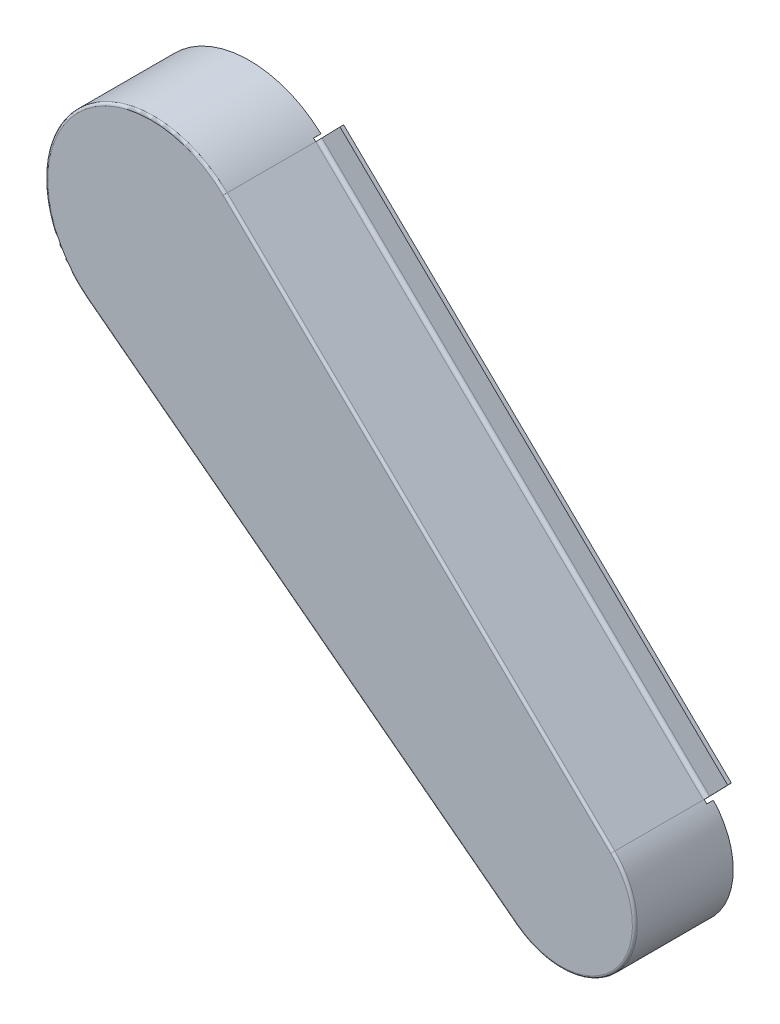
ISO-10303-21;
HEADER;
FILE_DESCRIPTION(('STEP AP214'),'2;1');
FILE_NAME('part.step','',(''),(''),'','','');
FILE_SCHEMA(('AUTOMOTIVE_DESIGN { 1 0 10303 214 1 1 1 1 }'));
ENDSEC;
DATA;
#1=APPLICATION_CONTEXT('core data for automotive mechanical design processes');
#2=APPLICATION_PROTOCOL_DEFINITION('international standard','automotive_design',2000,#1);
#3=PRODUCT_CONTEXT('',#1,'mechanical');
#4=PRODUCT('Part','Part','',(#3));
#5=PRODUCT_RELATED_PRODUCT_CATEGORY('part','',(#4));
#6=PRODUCT_DEFINITION_FORMATION('','',#4);
#7=PRODUCT_DEFINITION_CONTEXT('part definition',#1,'design');
#8=PRODUCT_DEFINITION('design','',#6,#7);
#9=PRODUCT_DEFINITION_SHAPE('','',#8);
#10=(LENGTH_UNIT() NAMED_UNIT(*) SI_UNIT(.MILLI.,.METRE.));
#11=(NAMED_UNIT(*) PLANE_ANGLE_UNIT() SI_UNIT($,.RADIAN.));
#12=(NAMED_UNIT(*) SI_UNIT($,.STERADIAN.) SOLID_ANGLE_UNIT());
#13=UNCERTAINTY_MEASURE_WITH_UNIT(LENGTH_MEASURE(1.E-05),#10,'distance_accuracy_value','');
#14=(GEOMETRIC_REPRESENTATION_CONTEXT(3) GLOBAL_UNCERTAINTY_ASSIGNED_CONTEXT((#13)) GLOBAL_UNIT_ASSIGNED_CONTEXT((#10,
#11,#12)) REPRESENTATION_CONTEXT('',''));
#15=CARTESIAN_POINT('',(0.,0.,0.));
#16=DIRECTION('',(0.,0.,1.));
#17=DIRECTION('',(1.,0.,0.));
#18=AXIS2_PLACEMENT_3D('',#15,#16,#17);
#19=CARTESIAN_POINT('',(28.2019886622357,29.0671263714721,37.5));
#20=DIRECTION('',(0.717706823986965,-0.696345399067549,0.));
#21=DIRECTION('',(0.696345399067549,0.717706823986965,0.));
#22=AXIS2_PLACEMENT_3D('',#19,#20,#21);
#23=CYLINDRICAL_SURFACE('',#22,1.);
#24=DIRECTION('',(0.717706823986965,-0.696345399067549,0.));
#25=VECTOR('',#24,1.);
#26=CARTESIAN_POINT('',(28.2019886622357,29.0671263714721,38.5));
#27=LINE('',#26,#25);
#28=CARTESIAN_POINT('',(28.2019886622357,29.0671263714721,38.5));
#29=VERTEX_POINT('',#28);
#30=CARTESIAN_POINT('',(185.821584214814,-123.86116760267,38.5));
#31=VERTEX_POINT('',#30);
#32=EDGE_CURVE('E404',#29,#31,#27,.T.);
#33=ORIENTED_EDGE('',*,*,#32,.F.);
#34=CARTESIAN_POINT('',(28.2019886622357,29.0671263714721,37.5));
#35=DIRECTION('',(0.717706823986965,-0.696345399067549,0.));
#36=DIRECTION('',(0.696345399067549,0.717706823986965,0.));
#37=AXIS2_PLACEMENT_3D('',#34,#35,#36);
#38=CIRCLE('',#37,1.);
#39=CARTESIAN_POINT('',(28.8983340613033,29.784833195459,37.5));
#40=VERTEX_POINT('',#39);
#41=EDGE_CURVE('E436',#29,#40,#38,.F.);
#42=ORIENTED_EDGE('',*,*,#41,.T.);
#43=DIRECTION('',(0.717706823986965,-0.696345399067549,0.));
#44=VECTOR('',#43,1.);
#45=CARTESIAN_POINT('',(28.8983340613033,29.784833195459,37.5));
#46=LINE('',#45,#44);
#47=CARTESIAN_POINT('',(186.517929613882,-123.143460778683,37.5));
#48=VERTEX_POINT('',#47);
#49=EDGE_CURVE('E182',#48,#40,#46,.F.);
#50=ORIENTED_EDGE('',*,*,#49,.F.);
#51=CARTESIAN_POINT('',(185.821584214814,-123.86116760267,37.5));
#52=DIRECTION('',(0.717706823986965,-0.696345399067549,0.));
#53=DIRECTION('',(0.696345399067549,0.717706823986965,0.));
#54=AXIS2_PLACEMENT_3D('',#51,#52,#53);
#55=CIRCLE('',#54,1.);
#56=EDGE_CURVE('E397',#31,#48,#55,.F.);
#57=ORIENTED_EDGE('',*,*,#56,.F.);
#58=EDGE_LOOP('',(#33,#42,#50,#57));
#59=FACE_BOUND('',#58,.T.);
#60=ADVANCED_FACE('F17',(#59),#23,.F.);
#61=CARTESIAN_POINT('',(0.,0.,38.5));
#62=DIRECTION('',(0.,0.,-1.));
#63=DIRECTION('',(-1.,0.,0.));
#64=AXIS2_PLACEMENT_3D('',#61,#62,#63);
#65=PLANE('',#64);
#66=CARTESIAN_POINT('',(0.,0.,38.5));
#67=DIRECTION('',(0.,0.,1.));
#68=DIRECTION('',(0.696345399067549,0.717706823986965,0.));
#69=AXIS2_PLACEMENT_3D('',#66,#67,#68);
#70=CIRCLE('',#69,40.5);
#71=CARTESIAN_POINT('',(-40.5,0.,38.5));
#72=VERTEX_POINT('',#71);
#73=EDGE_CURVE('E439',#72,#29,#70,.F.);
#74=ORIENTED_EDGE('',*,*,#73,.T.);
#75=ORIENTED_EDGE('',*,*,#32,.T.);
#76=CARTESIAN_POINT('',(166.672085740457,-143.598105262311,38.5));
#77=DIRECTION('',(0.,0.,1.));
#78=DIRECTION('',(-0.606810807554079,-0.794846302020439,0.));
#79=AXIS2_PLACEMENT_3D('',#76,#77,#78);
#80=CIRCLE('',#79,27.5);
#81=CARTESIAN_POINT('',(149.98478853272,-165.456378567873,38.5));
#82=VERTEX_POINT('',#81);
#83=EDGE_CURVE('E471',#31,#82,#80,.F.);
#84=ORIENTED_EDGE('',*,*,#83,.T.);
#85=DIRECTION('',(-0.794846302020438,0.606810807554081,0.));
#86=VECTOR('',#85,1.);
#87=CARTESIAN_POINT('',(-24.5758377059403,-32.1912752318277,38.5));
#88=LINE('',#87,#86);
#89=CARTESIAN_POINT('',(-24.5758377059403,-32.1912752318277,38.5));
#90=VERTEX_POINT('',#89);
#91=EDGE_CURVE('E462',#82,#90,#88,.T.);
#92=ORIENTED_EDGE('',*,*,#91,.T.);
#93=CARTESIAN_POINT('',(0.,0.,38.5));
#94=DIRECTION('',(0.,0.,1.));
#95=DIRECTION('',(-1.,0.,0.));
#96=AXIS2_PLACEMENT_3D('',#93,#94,#95);
#97=CIRCLE('',#96,40.5);
#98=EDGE_CURVE('E411',#90,#72,#97,.F.);
#99=ORIENTED_EDGE('',*,*,#98,.T.);
#100=EDGE_LOOP('',(#74,#75,#84,#92,#99));
#101=FACE_BOUND('',#100,.T.);
#102=ADVANCED_FACE('F476',(#101),#65,.T.);
#103=CARTESIAN_POINT('',(38.2989969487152,39.4738753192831,0.));
#104=DIRECTION('',(-0.696345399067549,-0.717706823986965,0.));
#105=DIRECTION('',(0.717706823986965,-0.696345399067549,0.));
#106=AXIS2_PLACEMENT_3D('',#103,#104,#105);
#107=PLANE('',#106);
#108=DIRECTION('',(0.,0.,1.));
#109=VECTOR('',#108,1.);
#110=CARTESIAN_POINT('',(38.2989969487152,39.4738753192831,0.));
#111=LINE('',#110,#109);
#112=CARTESIAN_POINT('',(38.2989969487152,39.4738753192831,1.49999999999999));
#113=VERTEX_POINT('',#112);
#114=CARTESIAN_POINT('',(38.2989969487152,39.4738753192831,0.));
#115=VERTEX_POINT('',#114);
#116=EDGE_CURVE('E444',#113,#115,#111,.F.);
#117=ORIENTED_EDGE('',*,*,#116,.F.);
#118=DIRECTION('',(0.717706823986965,-0.696345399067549,0.));
#119=VECTOR('',#118,1.);
#120=CARTESIAN_POINT('',(38.2989969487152,39.4738753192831,1.5));
#121=LINE('',#120,#119);
#122=CARTESIAN_POINT('',(195.918592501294,-113.454418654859,1.49999999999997));
#123=VERTEX_POINT('',#122);
#124=EDGE_CURVE('E449',#113,#123,#121,.T.);
#125=ORIENTED_EDGE('',*,*,#124,.T.);
#126=DIRECTION('',(0.,0.,1.));
#127=VECTOR('',#126,1.);
#128=CARTESIAN_POINT('',(195.918592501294,-113.454418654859,0.));
#129=LINE('',#128,#127);
#130=CARTESIAN_POINT('',(195.918592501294,-113.454418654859,0.));
#131=VERTEX_POINT('',#130);
#132=EDGE_CURVE('E456',#131,#123,#129,.T.);
#133=ORIENTED_EDGE('',*,*,#132,.F.);
#134=DIRECTION('',(0.717706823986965,-0.696345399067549,0.));
#135=VECTOR('',#134,1.);
#136=CARTESIAN_POINT('',(38.2989969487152,39.4738753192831,0.));
#137=LINE('',#136,#135);
#138=EDGE_CURVE('E440',#115,#131,#137,.T.);
#139=ORIENTED_EDGE('',*,*,#138,.F.);
#140=EDGE_LOOP('',(#117,#125,#133,#139));
#141=FACE_BOUND('',#140,.T.);
#142=ADVANCED_FACE('F485',(#141),#107,.F.);
#143=CARTESIAN_POINT('',(30.2910248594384,31.220246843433,2.));
#144=DIRECTION('',(-0.717706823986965,0.696345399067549,0.));
#145=DIRECTION('',(-0.696345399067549,-0.717706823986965,0.));
#146=AXIS2_PLACEMENT_3D('',#143,#144,#145);
#147=CYLINDRICAL_SURFACE('',#146,2.);
#148=CARTESIAN_POINT('',(30.2910248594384,31.220246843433,2.));
#149=DIRECTION('',(-0.717706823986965,0.696345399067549,0.));
#150=DIRECTION('',(-0.696345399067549,-0.717706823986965,0.));
#151=AXIS2_PLACEMENT_3D('',#148,#149,#150);
#152=CIRCLE('',#151,2.);
#153=CARTESIAN_POINT('',(28.8983340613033,29.784833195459,2.));
#154=VERTEX_POINT('',#153);
#155=CARTESIAN_POINT('',(30.2910248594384,31.220246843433,0.));
#156=VERTEX_POINT('',#155);
#157=EDGE_CURVE('E202',#154,#156,#152,.F.);
#158=ORIENTED_EDGE('',*,*,#157,.T.);
#159=DIRECTION('',(-0.717706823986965,0.696345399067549,0.));
#160=VECTOR('',#159,1.);
#161=CARTESIAN_POINT('',(187.910620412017,-121.708047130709,0.));
#162=LINE('',#161,#160);
#163=CARTESIAN_POINT('',(187.910620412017,-121.708047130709,0.));
#164=VERTEX_POINT('',#163);
#165=EDGE_CURVE('E167',#164,#156,#162,.T.);
#166=ORIENTED_EDGE('',*,*,#165,.F.);
#167=CARTESIAN_POINT('',(187.910620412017,-121.708047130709,2.));
#168=DIRECTION('',(-0.717706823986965,0.696345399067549,0.));
#169=DIRECTION('',(-0.696345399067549,-0.717706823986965,0.));
#170=AXIS2_PLACEMENT_3D('',#167,#168,#169);
#171=CIRCLE('',#170,2.);
#172=CARTESIAN_POINT('',(186.517929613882,-123.143460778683,2.));
#173=VERTEX_POINT('',#172);
#174=EDGE_CURVE('E188',#164,#173,#171,.T.);
#175=ORIENTED_EDGE('',*,*,#174,.T.);
#176=DIRECTION('',(0.717706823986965,-0.696345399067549,0.));
#177=VECTOR('',#176,1.);
#178=CARTESIAN_POINT('',(28.8983340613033,29.784833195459,2.));
#179=LINE('',#178,#177);
#180=EDGE_CURVE('E173',#154,#173,#179,.T.);
#181=ORIENTED_EDGE('',*,*,#180,.F.);
#182=EDGE_LOOP('',(#158,#166,#175,#181));
#183=FACE_BOUND('',#182,.T.);
#184=ADVANCED_FACE('F195',(#183),#147,.T.);
#185=CARTESIAN_POINT('',(0.,0.,0.));
#186=DIRECTION('',(0.,0.,-1.));
#187=DIRECTION('',(-1.,0.,0.));
#188=AXIS2_PLACEMENT_3D('',#185,#186,#187);
#189=PLANE('',#188);
#190=DIRECTION('',(0.696345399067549,0.717706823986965,0.));
#191=VECTOR('',#190,1.);
#192=CARTESIAN_POINT('',(38.2989969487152,39.4738753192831,0.));
#193=LINE('',#192,#191);
#194=EDGE_CURVE('E342',#156,#115,#193,.T.);
#195=ORIENTED_EDGE('',*,*,#194,.T.);
#196=ORIENTED_EDGE('',*,*,#138,.T.);
#197=DIRECTION('',(-0.696345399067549,-0.717706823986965,0.));
#198=VECTOR('',#197,1.);
#199=CARTESIAN_POINT('',(195.918592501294,-113.454418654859,0.));
#200=LINE('',#199,#198);
#201=EDGE_CURVE('E196',#131,#164,#200,.T.);
#202=ORIENTED_EDGE('',*,*,#201,.T.);
#203=ORIENTED_EDGE('',*,*,#165,.T.);
#204=EDGE_LOOP('',(#195,#196,#202,#203));
#205=FACE_BOUND('',#204,.T.);
#206=ADVANCED_FACE('F428',(#205),#189,.T.);
#207=CARTESIAN_POINT('',(0.,0.,37.5));
#208=DIRECTION('',(0.,0.,-1.));
#209=DIRECTION('',(-1.,0.,0.));
#210=AXIS2_PLACEMENT_3D('',#207,#208,#209);
#211=TOROIDAL_SURFACE('',#210,40.5,1.);
#212=ORIENTED_EDGE('',*,*,#98,.F.);
#213=CARTESIAN_POINT('',(-24.5758377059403,-32.1912752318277,37.5));
#214=DIRECTION('',(-0.794846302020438,0.606810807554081,0.));
#215=DIRECTION('',(-0.606810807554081,-0.794846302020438,0.));
#216=AXIS2_PLACEMENT_3D('',#213,#214,#215);
#217=CIRCLE('',#216,1.);
#218=CARTESIAN_POINT('',(-25.1826485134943,-32.9861215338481,37.5));
#219=VERTEX_POINT('',#218);
#220=EDGE_CURVE('E183',#90,#219,#217,.F.);
#221=ORIENTED_EDGE('',*,*,#220,.T.);
#222=CARTESIAN_POINT('',(0.,0.,37.5));
#223=DIRECTION('',(0.,0.,-1.));
#224=DIRECTION('',(-1.,0.,0.));
#225=AXIS2_PLACEMENT_3D('',#222,#223,#224);
#226=CIRCLE('',#225,41.5);
#227=EDGE_CURVE('E337',#219,#40,#226,.T.);
#228=ORIENTED_EDGE('',*,*,#227,.T.);
#229=ORIENTED_EDGE('',*,*,#41,.F.);
#230=ORIENTED_EDGE('',*,*,#73,.F.);
#231=EDGE_LOOP('',(#212,#221,#228,#229,#230));
#232=FACE_BOUND('',#231,.T.);
#233=ADVANCED_FACE('F417',(#232),#211,.F.);
#234=CARTESIAN_POINT('',(-24.5758377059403,-32.1912752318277,37.5));
#235=DIRECTION('',(-0.794846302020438,0.606810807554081,0.));
#236=DIRECTION('',(-0.606810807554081,-0.794846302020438,0.));
#237=AXIS2_PLACEMENT_3D('',#234,#235,#236);
#238=CYLINDRICAL_SURFACE('',#237,1.);
#239=ORIENTED_EDGE('',*,*,#91,.F.);
#240=CARTESIAN_POINT('',(149.98478853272,-165.456378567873,37.5));
#241=DIRECTION('',(-0.794846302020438,0.606810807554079,0.));
#242=DIRECTION('',(-0.606810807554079,-0.794846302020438,0.));
#243=AXIS2_PLACEMENT_3D('',#240,#241,#242);
#244=CIRCLE('',#243,1.);
#245=CARTESIAN_POINT('',(149.377977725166,-166.251224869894,37.5));
#246=VERTEX_POINT('',#245);
#247=EDGE_CURVE('E378',#82,#246,#244,.F.);
#248=ORIENTED_EDGE('',*,*,#247,.T.);
#249=DIRECTION('',(-0.794846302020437,0.606810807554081,0.));
#250=VECTOR('',#249,1.);
#251=CARTESIAN_POINT('',(-25.1826485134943,-32.9861215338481,37.5));
#252=LINE('',#251,#250);
#253=EDGE_CURVE('E336',#219,#246,#252,.F.);
#254=ORIENTED_EDGE('',*,*,#253,.F.);
#255=ORIENTED_EDGE('',*,*,#220,.F.);
#256=EDGE_LOOP('',(#239,#248,#254,#255));
#257=FACE_BOUND('',#256,.T.);
#258=ADVANCED_FACE('F427',(#257),#238,.F.);
#259=CARTESIAN_POINT('',(28.8983340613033,29.784833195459,40.));
#260=DIRECTION('',(-0.696345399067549,-0.717706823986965,0.));
#261=DIRECTION('',(0.717706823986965,-0.696345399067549,0.));
#262=AXIS2_PLACEMENT_3D('',#259,#260,#261);
#263=PLANE('',#262);
#264=ORIENTED_EDGE('',*,*,#49,.T.);
#265=DIRECTION('',(0.,0.,-1.));
#266=VECTOR('',#265,1.);
#267=CARTESIAN_POINT('',(28.8983340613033,29.784833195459,40.));
#268=LINE('',#267,#266);
#269=CARTESIAN_POINT('',(28.8983340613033,29.784833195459,3.00000000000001));
#270=VERTEX_POINT('',#269);
#271=EDGE_CURVE('E345',#40,#270,#268,.T.);
#272=ORIENTED_EDGE('',*,*,#271,.T.);
#273=DIRECTION('',(0.,0.,1.));
#274=VECTOR('',#273,1.);
#275=CARTESIAN_POINT('',(28.8983340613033,29.7848331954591,0.));
#276=LINE('',#275,#274);
#277=EDGE_CURVE('E180',#270,#154,#276,.F.);
#278=ORIENTED_EDGE('',*,*,#277,.T.);
#279=ORIENTED_EDGE('',*,*,#180,.T.);
#280=DIRECTION('',(0.,0.,1.));
#281=VECTOR('',#280,1.);
#282=CARTESIAN_POINT('',(186.517929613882,-123.143460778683,0.));
#283=LINE('',#282,#281);
#284=CARTESIAN_POINT('',(186.517929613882,-123.143460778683,2.71831865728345));
#285=VERTEX_POINT('',#284);
#286=EDGE_CURVE('E178',#173,#285,#283,.T.);
#287=ORIENTED_EDGE('',*,*,#286,.T.);
#288=DIRECTION('',(0.,0.,-1.));
#289=VECTOR('',#288,1.);
#290=CARTESIAN_POINT('',(186.517929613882,-123.143460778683,40.));
#291=LINE('',#290,#289);
#292=EDGE_CURVE('E373',#285,#48,#291,.F.);
#293=ORIENTED_EDGE('',*,*,#292,.T.);
#294=EDGE_LOOP('',(#264,#272,#278,#279,#287,#293));
#295=FACE_BOUND('',#294,.T.);
#296=ADVANCED_FACE('F176',(#295),#263,.T.);
#297=CARTESIAN_POINT('',(166.672085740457,-143.598105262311,37.5));
#298=DIRECTION('',(0.,0.,-1.));
#299=DIRECTION('',(-1.,0.,0.));
#300=AXIS2_PLACEMENT_3D('',#297,#298,#299);
#301=TOROIDAL_SURFACE('',#300,27.5,1.);
#302=CARTESIAN_POINT('',(166.672085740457,-143.598105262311,37.5));
#303=DIRECTION('',(0.,0.,-1.));
#304=DIRECTION('',(-1.,0.,0.));
#305=AXIS2_PLACEMENT_3D('',#302,#303,#304);
#306=CIRCLE('',#305,28.5);
#307=EDGE_CURVE('E330',#48,#246,#306,.T.);
#308=ORIENTED_EDGE('',*,*,#307,.T.);
#309=ORIENTED_EDGE('',*,*,#247,.F.);
#310=ORIENTED_EDGE('',*,*,#83,.F.);
#311=ORIENTED_EDGE('',*,*,#56,.T.);
#312=EDGE_LOOP('',(#308,#309,#310,#311));
#313=FACE_BOUND('',#312,.T.);
#314=ADVANCED_FACE('F381',(#313),#301,.F.);
#315=CARTESIAN_POINT('',(38.2989969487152,39.4738753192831,1.5));
#316=DIRECTION('',(0.,0.,-1.));
#317=DIRECTION('',(-1.,0.,0.));
#318=AXIS2_PLACEMENT_3D('',#315,#316,#317);
#319=PLANE('',#318);
#320=DIRECTION('',(-0.717706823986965,0.696345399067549,0.));
#321=VECTOR('',#320,1.);
#322=CARTESIAN_POINT('',(30.9873702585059,31.9379536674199,1.5));
#323=LINE('',#322,#321);
#324=CARTESIAN_POINT('',(30.9873702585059,31.9379536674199,1.5));
#325=VERTEX_POINT('',#324);
#326=CARTESIAN_POINT('',(188.606965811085,-120.990340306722,1.49999999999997));
#327=VERTEX_POINT('',#326);
#328=EDGE_CURVE('E319',#325,#327,#323,.F.);
#329=ORIENTED_EDGE('',*,*,#328,.T.);
#330=DIRECTION('',(-0.696345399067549,-0.717706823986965,0.));
#331=VECTOR('',#330,1.);
#332=CARTESIAN_POINT('',(195.918592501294,-113.454418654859,1.49999999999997));
#333=LINE('',#332,#331);
#334=EDGE_CURVE('E198',#327,#123,#333,.F.);
#335=ORIENTED_EDGE('',*,*,#334,.T.);
#336=ORIENTED_EDGE('',*,*,#124,.F.);
#337=DIRECTION('',(0.696345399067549,0.717706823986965,0.));
#338=VECTOR('',#337,1.);
#339=CARTESIAN_POINT('',(38.2989969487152,39.4738753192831,1.5));
#340=LINE('',#339,#338);
#341=EDGE_CURVE('E193',#113,#325,#340,.F.);
#342=ORIENTED_EDGE('',*,*,#341,.T.);
#343=EDGE_LOOP('',(#329,#335,#336,#342));
#344=FACE_BOUND('',#343,.T.);
#345=ADVANCED_FACE('F386',(#344),#319,.F.);
#346=CARTESIAN_POINT('',(195.918592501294,-113.454418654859,0.));
#347=DIRECTION('',(-0.717706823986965,0.696345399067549,0.));
#348=DIRECTION('',(-0.696345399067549,-0.717706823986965,0.));
#349=AXIS2_PLACEMENT_3D('',#346,#347,#348);
#350=PLANE('',#349);
#351=ORIENTED_EDGE('',*,*,#174,.F.);
#352=ORIENTED_EDGE('',*,*,#201,.F.);
#353=ORIENTED_EDGE('',*,*,#132,.T.);
#354=ORIENTED_EDGE('',*,*,#334,.F.);
#355=CARTESIAN_POINT('',(188.606965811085,-120.990340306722,2.99999999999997));
#356=DIRECTION('',(-0.717706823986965,0.696345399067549,0.));
#357=DIRECTION('',(-0.696345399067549,-0.717706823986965,0.));
#358=AXIS2_PLACEMENT_3D('',#355,#356,#357);
#359=CIRCLE('',#358,1.5);
#360=CARTESIAN_POINT('',(187.562447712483,-122.066900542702,2.99999999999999));
#361=VERTEX_POINT('',#360);
#362=EDGE_CURVE('E354',#327,#361,#359,.T.);
#363=ORIENTED_EDGE('',*,*,#362,.T.);
#364=DIRECTION('',(0.,0.,1.));
#365=VECTOR('',#364,1.);
#366=CARTESIAN_POINT('',(187.562447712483,-122.066900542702,0.));
#367=LINE('',#366,#365);
#368=CARTESIAN_POINT('',(187.562447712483,-122.066900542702,2.71831865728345));
#369=VERTEX_POINT('',#368);
#370=EDGE_CURVE('E360',#369,#361,#367,.T.);
#371=ORIENTED_EDGE('',*,*,#370,.F.);
#372=DIRECTION('',(-0.696345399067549,-0.717706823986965,0.));
#373=VECTOR('',#372,1.);
#374=CARTESIAN_POINT('',(195.918592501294,-113.454418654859,2.71831865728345));
#375=LINE('',#374,#373);
#376=EDGE_CURVE('E191',#285,#369,#375,.F.);
#377=ORIENTED_EDGE('',*,*,#376,.F.);
#378=ORIENTED_EDGE('',*,*,#286,.F.);
#379=EDGE_LOOP('',(#351,#352,#353,#354,#363,#371,#377,#378));
#380=FACE_BOUND('',#379,.T.);
#381=ADVANCED_FACE('F186',(#380),#350,.F.);
#382=CARTESIAN_POINT('',(38.2989969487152,39.4738753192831,0.));
#383=DIRECTION('',(0.717706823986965,-0.696345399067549,0.));
#384=DIRECTION('',(0.696345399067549,0.717706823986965,0.));
#385=AXIS2_PLACEMENT_3D('',#382,#383,#384);
#386=PLANE('',#385);
#387=ORIENTED_EDGE('',*,*,#157,.F.);
#388=ORIENTED_EDGE('',*,*,#277,.F.);
#389=DIRECTION('',(0.696345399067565,0.717706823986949,0.));
#390=VECTOR('',#389,1.);
#391=CARTESIAN_POINT('',(28.8983340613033,29.784833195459,3.00000000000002));
#392=LINE('',#391,#390);
#393=CARTESIAN_POINT('',(29.9428521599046,30.8613934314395,3.00000000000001));
#394=VERTEX_POINT('',#393);
#395=EDGE_CURVE('E321',#270,#394,#392,.T.);
#396=ORIENTED_EDGE('',*,*,#395,.T.);
#397=CARTESIAN_POINT('',(30.987370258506,31.9379536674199,3.));
#398=DIRECTION('',(-0.717706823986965,0.696345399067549,0.));
#399=DIRECTION('',(-0.696345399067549,-0.717706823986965,0.));
#400=AXIS2_PLACEMENT_3D('',#397,#398,#399);
#401=CIRCLE('',#400,1.5);
#402=EDGE_CURVE('E313',#394,#325,#401,.F.);
#403=ORIENTED_EDGE('',*,*,#402,.T.);
#404=ORIENTED_EDGE('',*,*,#341,.F.);
#405=ORIENTED_EDGE('',*,*,#116,.T.);
#406=ORIENTED_EDGE('',*,*,#194,.F.);
#407=EDGE_LOOP('',(#387,#388,#396,#403,#404,#405,#406));
#408=FACE_BOUND('',#407,.T.);
#409=ADVANCED_FACE('F654',(#408),#386,.F.);
#410=CARTESIAN_POINT('',(0.,0.,40.));
#411=DIRECTION('',(0.,0.,-1.));
#412=DIRECTION('',(-1.,0.,0.));
#413=AXIS2_PLACEMENT_3D('',#410,#411,#412);
#414=CYLINDRICAL_SURFACE('',#413,41.5);
#415=ORIENTED_EDGE('',*,*,#227,.F.);
#416=DIRECTION('',(0.,0.,1.));
#417=VECTOR('',#416,1.);
#418=CARTESIAN_POINT('',(-25.1826485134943,-32.9861215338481,40.));
#419=LINE('',#418,#417);
#420=CARTESIAN_POINT('',(-25.1826485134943,-32.9861215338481,0.));
#421=VERTEX_POINT('',#420);
#422=EDGE_CURVE('E333',#421,#219,#419,.T.);
#423=ORIENTED_EDGE('',*,*,#422,.F.);
#424=CARTESIAN_POINT('',(0.,0.,0.));
#425=DIRECTION('',(0.,0.,-1.));
#426=DIRECTION('',(-1.,0.,0.));
#427=AXIS2_PLACEMENT_3D('',#424,#425,#426);
#428=CIRCLE('',#427,41.5);
#429=CARTESIAN_POINT('',(28.0172290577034,30.6151086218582,0.));
#430=VERTEX_POINT('',#429);
#431=EDGE_CURVE('E309',#430,#421,#428,.F.);
#432=ORIENTED_EDGE('',*,*,#431,.F.);
#433=DIRECTION('',(0.,0.,1.));
#434=VECTOR('',#433,1.);
#435=CARTESIAN_POINT('',(28.0172290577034,30.6151086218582,0.));
#436=LINE('',#435,#434);
#437=CARTESIAN_POINT('',(28.0172290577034,30.6151086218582,3.00000000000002));
#438=VERTEX_POINT('',#437);
#439=EDGE_CURVE('E320',#430,#438,#436,.T.);
#440=ORIENTED_EDGE('',*,*,#439,.T.);
#441=CARTESIAN_POINT('',(0.,0.,3.00000000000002));
#442=DIRECTION('',(0.,0.,-1.));
#443=DIRECTION('',(-1.,0.,0.));
#444=AXIS2_PLACEMENT_3D('',#441,#442,#443);
#445=CIRCLE('',#444,41.5);
#446=EDGE_CURVE('E324',#438,#270,#445,.T.);
#447=ORIENTED_EDGE('',*,*,#446,.T.);
#448=ORIENTED_EDGE('',*,*,#271,.F.);
#449=EDGE_LOOP('',(#415,#423,#432,#440,#447,#448));
#450=FACE_BOUND('',#449,.T.);
#451=ADVANCED_FACE('F525',(#450),#414,.F.);
#452=CARTESIAN_POINT('',(-25.1826485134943,-32.9861215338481,40.));
#453=DIRECTION('',(0.606810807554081,0.794846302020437,0.));
#454=DIRECTION('',(-0.794846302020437,0.606810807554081,0.));
#455=AXIS2_PLACEMENT_3D('',#452,#453,#454);
#456=PLANE('',#455);
#457=DIRECTION('',(0.,0.,-1.));
#458=VECTOR('',#457,1.);
#459=CARTESIAN_POINT('',(149.377977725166,-166.251224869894,40.));
#460=LINE('',#459,#458);
#461=CARTESIAN_POINT('',(149.377977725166,-166.251224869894,0.));
#462=VERTEX_POINT('',#461);
#463=EDGE_CURVE('E327',#246,#462,#460,.T.);
#464=ORIENTED_EDGE('',*,*,#463,.T.);
#465=DIRECTION('',(0.794846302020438,-0.606810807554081,0.));
#466=VECTOR('',#465,1.);
#467=CARTESIAN_POINT('',(-25.1826485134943,-32.9861215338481,0.));
#468=LINE('',#467,#466);
#469=EDGE_CURVE('E306',#421,#462,#468,.T.);
#470=ORIENTED_EDGE('',*,*,#469,.F.);
#471=ORIENTED_EDGE('',*,*,#422,.T.);
#472=ORIENTED_EDGE('',*,*,#253,.T.);
#473=EDGE_LOOP('',(#464,#470,#471,#472));
#474=FACE_BOUND('',#473,.T.);
#475=ADVANCED_FACE('F529',(#474),#456,.T.);
#476=CARTESIAN_POINT('',(166.672085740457,-143.598105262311,40.));
#477=DIRECTION('',(0.,0.,-1.));
#478=DIRECTION('',(-1.,0.,0.));
#479=AXIS2_PLACEMENT_3D('',#476,#477,#478);
#480=CYLINDRICAL_SURFACE('',#479,28.5);
#481=CARTESIAN_POINT('',(166.672085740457,-143.598105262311,0.));
#482=DIRECTION('',(0.,0.,-1.));
#483=DIRECTION('',(-1.,0.,0.));
#484=AXIS2_PLACEMENT_3D('',#481,#482,#483);
#485=CIRCLE('',#484,28.5);
#486=CARTESIAN_POINT('',(187.571799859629,-124.221522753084,0.));
#487=VERTEX_POINT('',#486);
#488=EDGE_CURVE('E308',#462,#487,#485,.F.);
#489=ORIENTED_EDGE('',*,*,#488,.F.);
#490=ORIENTED_EDGE('',*,*,#463,.F.);
#491=ORIENTED_EDGE('',*,*,#307,.F.);
#492=ORIENTED_EDGE('',*,*,#292,.F.);
#493=CARTESIAN_POINT('',(166.672085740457,-143.598105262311,2.71831865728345));
#494=DIRECTION('',(0.,0.,-1.));
#495=DIRECTION('',(-1.,0.,0.));
#496=AXIS2_PLACEMENT_3D('',#493,#494,#495);
#497=CIRCLE('',#496,28.5);
#498=CARTESIAN_POINT('',(187.571799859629,-124.221522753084,2.71831865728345));
#499=VERTEX_POINT('',#498);
#500=EDGE_CURVE('E368',#499,#285,#497,.F.);
#501=ORIENTED_EDGE('',*,*,#500,.F.);
#502=DIRECTION('',(0.,0.,1.));
#503=VECTOR('',#502,1.);
#504=CARTESIAN_POINT('',(187.571799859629,-124.221522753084,0.));
#505=LINE('',#504,#503);
#506=EDGE_CURVE('E305',#499,#487,#505,.F.);
#507=ORIENTED_EDGE('',*,*,#506,.T.);
#508=EDGE_LOOP('',(#489,#490,#491,#492,#501,#507));
#509=FACE_BOUND('',#508,.T.);
#510=ADVANCED_FACE('F552',(#509),#480,.F.);
#511=CARTESIAN_POINT('',(21.586707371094,22.2489115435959,3.00000000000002));
#512=DIRECTION('',(0.,0.,1.));
#513=DIRECTION('',(1.,0.,0.));
#514=AXIS2_PLACEMENT_3D('',#511,#512,#513);
#515=PLANE('',#514);
#516=ORIENTED_EDGE('',*,*,#446,.F.);
#517=DIRECTION('',(-0.696345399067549,-0.717706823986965,0.));
#518=VECTOR('',#517,1.);
#519=CARTESIAN_POINT('',(20.7178991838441,23.091861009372,3.00000000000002));
#520=LINE('',#519,#518);
#521=CARTESIAN_POINT('',(29.0621762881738,31.6921111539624,3.00000000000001));
#522=VERTEX_POINT('',#521);
#523=EDGE_CURVE('E316',#438,#522,#520,.F.);
#524=ORIENTED_EDGE('',*,*,#523,.T.);
#525=CARTESIAN_POINT('',(0.,0.,3.));
#526=DIRECTION('',(0.,0.,-1.));
#527=DIRECTION('',(-1.,0.,0.));
#528=AXIS2_PLACEMENT_3D('',#525,#526,#527);
#529=CIRCLE('',#528,43.);
#530=EDGE_CURVE('E288',#394,#522,#529,.F.);
#531=ORIENTED_EDGE('',*,*,#530,.F.);
#532=ORIENTED_EDGE('',*,*,#395,.F.);
#533=EDGE_LOOP('',(#516,#524,#531,#532));
#534=FACE_BOUND('',#533,.T.);
#535=ADVANCED_FACE('F575',(#534),#515,.F.);
#536=CARTESIAN_POINT('',(20.7178991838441,23.091861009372,0.));
#537=DIRECTION('',(-0.717706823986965,0.696345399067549,0.));
#538=DIRECTION('',(-0.696345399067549,-0.717706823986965,0.));
#539=AXIS2_PLACEMENT_3D('',#536,#537,#538);
#540=PLANE('',#539);
#541=ORIENTED_EDGE('',*,*,#439,.F.);
#542=DIRECTION('',(-0.69634539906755,-0.717706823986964,0.));
#543=VECTOR('',#542,1.);
#544=CARTESIAN_POINT('',(29.0621762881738,31.6921111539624,0.));
#545=LINE('',#544,#543);
#546=CARTESIAN_POINT('',(29.0621762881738,31.6921111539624,0.));
#547=VERTEX_POINT('',#546);
#548=EDGE_CURVE('E310',#547,#430,#545,.T.);
#549=ORIENTED_EDGE('',*,*,#548,.F.);
#550=DIRECTION('',(0.,0.,-1.));
#551=VECTOR('',#550,1.);
#552=CARTESIAN_POINT('',(29.0621762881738,31.6921111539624,40.));
#553=LINE('',#552,#551);
#554=EDGE_CURVE('E314',#522,#547,#553,.T.);
#555=ORIENTED_EDGE('',*,*,#554,.F.);
#556=ORIENTED_EDGE('',*,*,#523,.F.);
#557=EDGE_LOOP('',(#541,#549,#555,#556));
#558=FACE_BOUND('',#557,.T.);
#559=ADVANCED_FACE('F577',(#558),#540,.F.);
#560=CARTESIAN_POINT('',(30.9873702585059,31.9379536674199,3.));
#561=DIRECTION('',(-0.717706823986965,0.696345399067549,0.));
#562=DIRECTION('',(-0.696345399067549,-0.717706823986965,0.));
#563=AXIS2_PLACEMENT_3D('',#560,#561,#562);
#564=CYLINDRICAL_SURFACE('',#563,1.5);
#565=DIRECTION('',(0.717706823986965,-0.696345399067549,0.));
#566=VECTOR('',#565,1.);
#567=CARTESIAN_POINT('',(29.9428521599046,30.8613934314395,3.));
#568=LINE('',#567,#566);
#569=EDGE_CURVE('E281',#394,#361,#568,.T.);
#570=ORIENTED_EDGE('',*,*,#569,.T.);
#571=ORIENTED_EDGE('',*,*,#362,.F.);
#572=ORIENTED_EDGE('',*,*,#328,.F.);
#573=ORIENTED_EDGE('',*,*,#402,.F.);
#574=EDGE_LOOP('',(#570,#571,#572,#573));
#575=FACE_BOUND('',#574,.T.);
#576=ADVANCED_FACE('F651',(#575),#564,.F.);
#577=CARTESIAN_POINT('',(0.,0.,0.));
#578=DIRECTION('',(0.,0.,-1.));
#579=DIRECTION('',(-1.,0.,0.));
#580=AXIS2_PLACEMENT_3D('',#577,#578,#579);
#581=PLANE('',#580);
#582=ORIENTED_EDGE('',*,*,#469,.T.);
#583=ORIENTED_EDGE('',*,*,#488,.T.);
#584=DIRECTION('',(0.696345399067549,0.717706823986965,0.));
#585=VECTOR('',#584,1.);
#586=CARTESIAN_POINT('',(180.28793976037,-131.728826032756,0.));
#587=LINE('',#586,#585);
#588=CARTESIAN_POINT('',(188.617708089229,-123.143529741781,0.));
#589=VERTEX_POINT('',#588);
#590=EDGE_CURVE('E300',#487,#589,#587,.T.);
#591=ORIENTED_EDGE('',*,*,#590,.T.);
#592=CARTESIAN_POINT('',(166.672085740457,-143.598105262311,0.));
#593=DIRECTION('',(0.,0.,-1.));
#594=DIRECTION('',(-1.,0.,0.));
#595=AXIS2_PLACEMENT_3D('',#592,#593,#594);
#596=CIRCLE('',#595,30.);
#597=CARTESIAN_POINT('',(148.467761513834,-167.443494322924,0.));
#598=VERTEX_POINT('',#597);
#599=EDGE_CURVE('E297',#598,#589,#596,.F.);
#600=ORIENTED_EDGE('',*,*,#599,.F.);
#601=DIRECTION('',(-0.794846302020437,0.606810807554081,0.));
#602=VECTOR('',#601,1.);
#603=CARTESIAN_POINT('',(-26.0928647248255,-34.1783909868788,0.));
#604=LINE('',#603,#602);
#605=CARTESIAN_POINT('',(-26.0928647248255,-34.1783909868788,0.));
#606=VERTEX_POINT('',#605);
#607=EDGE_CURVE('E289',#598,#606,#604,.T.);
#608=ORIENTED_EDGE('',*,*,#607,.T.);
#609=CARTESIAN_POINT('',(0.,0.,0.));
#610=DIRECTION('',(0.,0.,-1.));
#611=DIRECTION('',(-1.,0.,0.));
#612=AXIS2_PLACEMENT_3D('',#609,#610,#611);
#613=CIRCLE('',#612,43.);
#614=EDGE_CURVE('E282',#547,#606,#613,.F.);
#615=ORIENTED_EDGE('',*,*,#614,.F.);
#616=ORIENTED_EDGE('',*,*,#548,.T.);
#617=ORIENTED_EDGE('',*,*,#431,.T.);
#618=EDGE_LOOP('',(#582,#583,#591,#600,#608,#615,#616,#617));
#619=FACE_BOUND('',#618,.T.);
#620=ADVANCED_FACE('F533',(#619),#581,.T.);
#621=CARTESIAN_POINT('',(180.28793976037,-131.728826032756,0.));
#622=DIRECTION('',(0.717706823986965,-0.696345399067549,0.));
#623=DIRECTION('',(0.696345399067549,0.717706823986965,0.));
#624=AXIS2_PLACEMENT_3D('',#621,#622,#623);
#625=PLANE('',#624);
#626=ORIENTED_EDGE('',*,*,#506,.F.);
#627=DIRECTION('',(0.69634539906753,0.717706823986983,0.));
#628=VECTOR('',#627,1.);
#629=CARTESIAN_POINT('',(187.571799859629,-124.221522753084,2.71831865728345));
#630=LINE('',#629,#628);
#631=CARTESIAN_POINT('',(188.617708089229,-123.143529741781,2.71831865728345));
#632=VERTEX_POINT('',#631);
#633=EDGE_CURVE('E294',#499,#632,#630,.T.);
#634=ORIENTED_EDGE('',*,*,#633,.T.);
#635=DIRECTION('',(0.,0.,-1.));
#636=VECTOR('',#635,1.);
#637=CARTESIAN_POINT('',(188.617708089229,-123.143529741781,40.));
#638=LINE('',#637,#636);
#639=EDGE_CURVE('E301',#589,#632,#638,.F.);
#640=ORIENTED_EDGE('',*,*,#639,.F.);
#641=ORIENTED_EDGE('',*,*,#590,.F.);
#642=EDGE_LOOP('',(#626,#634,#640,#641));
#643=FACE_BOUND('',#642,.T.);
#644=ADVANCED_FACE('F555',(#643),#625,.F.);
#645=CARTESIAN_POINT('',(179.206302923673,-130.679382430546,2.71831865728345));
#646=DIRECTION('',(0.,0.,1.));
#647=DIRECTION('',(1.,0.,0.));
#648=AXIS2_PLACEMENT_3D('',#645,#646,#647);
#649=PLANE('',#648);
#650=ORIENTED_EDGE('',*,*,#500,.T.);
#651=ORIENTED_EDGE('',*,*,#376,.T.);
#652=CARTESIAN_POINT('',(166.672085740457,-143.598105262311,2.71831865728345));
#653=DIRECTION('',(0.,0.,-1.));
#654=DIRECTION('',(-1.,0.,0.));
#655=AXIS2_PLACEMENT_3D('',#652,#653,#654);
#656=CIRCLE('',#655,30.);
#657=EDGE_CURVE('E265',#632,#369,#656,.F.);
#658=ORIENTED_EDGE('',*,*,#657,.F.);
#659=ORIENTED_EDGE('',*,*,#633,.F.);
#660=EDGE_LOOP('',(#650,#651,#658,#659));
#661=FACE_BOUND('',#660,.T.);
#662=ADVANCED_FACE('F558',(#661),#649,.F.);
#663=CARTESIAN_POINT('',(-26.0928647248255,-34.1783909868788,40.));
#664=DIRECTION('',(0.606810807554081,0.794846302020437,0.));
#665=DIRECTION('',(-0.794846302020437,0.606810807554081,0.));
#666=AXIS2_PLACEMENT_3D('',#663,#664,#665);
#667=PLANE('',#666);
#668=DIRECTION('',(0.794846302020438,-0.606810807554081,0.));
#669=VECTOR('',#668,1.);
#670=CARTESIAN_POINT('',(-26.0928647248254,-34.1783909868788,39.));
#671=LINE('',#670,#669);
#672=CARTESIAN_POINT('',(-26.0928647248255,-34.1783909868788,39.));
#673=VERTEX_POINT('',#672);
#674=CARTESIAN_POINT('',(148.467761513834,-167.443494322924,39.));
#675=VERTEX_POINT('',#674);
#676=EDGE_CURVE('E248',#673,#675,#671,.T.);
#677=ORIENTED_EDGE('',*,*,#676,.F.);
#678=DIRECTION('',(0.,0.,-1.));
#679=VECTOR('',#678,1.);
#680=CARTESIAN_POINT('',(-26.0928647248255,-34.1783909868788,40.));
#681=LINE('',#680,#679);
#682=EDGE_CURVE('E285',#606,#673,#681,.F.);
#683=ORIENTED_EDGE('',*,*,#682,.F.);
#684=ORIENTED_EDGE('',*,*,#607,.F.);
#685=DIRECTION('',(0.,0.,-1.));
#686=VECTOR('',#685,1.);
#687=CARTESIAN_POINT('',(148.467761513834,-167.443494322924,40.));
#688=LINE('',#687,#686);
#689=EDGE_CURVE('E264',#675,#598,#688,.T.);
#690=ORIENTED_EDGE('',*,*,#689,.F.);
#691=EDGE_LOOP('',(#677,#683,#684,#690));
#692=FACE_BOUND('',#691,.T.);
#693=ADVANCED_FACE('F582',(#692),#667,.F.);
#694=CARTESIAN_POINT('',(0.,0.,40.));
#695=DIRECTION('',(0.,0.,-1.));
#696=DIRECTION('',(-1.,0.,0.));
#697=AXIS2_PLACEMENT_3D('',#694,#695,#696);
#698=CYLINDRICAL_SURFACE('',#697,43.);
#699=ORIENTED_EDGE('',*,*,#554,.T.);
#700=ORIENTED_EDGE('',*,*,#614,.T.);
#701=ORIENTED_EDGE('',*,*,#682,.T.);
#702=CARTESIAN_POINT('',(0.,0.,39.));
#703=DIRECTION('',(0.,0.,-1.));
#704=DIRECTION('',(-1.,0.,0.));
#705=AXIS2_PLACEMENT_3D('',#702,#703,#704);
#706=CIRCLE('',#705,43.);
#707=CARTESIAN_POINT('',(29.9428521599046,30.8613934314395,39.));
#708=VERTEX_POINT('',#707);
#709=EDGE_CURVE('E247',#708,#673,#706,.F.);
#710=ORIENTED_EDGE('',*,*,#709,.F.);
#711=DIRECTION('',(0.,0.,1.));
#712=VECTOR('',#711,1.);
#713=CARTESIAN_POINT('',(29.9428521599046,30.8613934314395,40.));
#714=LINE('',#713,#712);
#715=EDGE_CURVE('E278',#708,#394,#714,.F.);
#716=ORIENTED_EDGE('',*,*,#715,.T.);
#717=ORIENTED_EDGE('',*,*,#530,.T.);
#718=EDGE_LOOP('',(#699,#700,#701,#710,#716,#717));
#719=FACE_BOUND('',#718,.T.);
#720=ADVANCED_FACE('F568',(#719),#698,.T.);
#721=CARTESIAN_POINT('',(29.9428521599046,30.8613934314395,40.));
#722=DIRECTION('',(-0.696345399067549,-0.717706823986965,0.));
#723=DIRECTION('',(0.717706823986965,-0.696345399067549,0.));
#724=AXIS2_PLACEMENT_3D('',#721,#722,#723);
#725=PLANE('',#724);
#726=ORIENTED_EDGE('',*,*,#569,.F.);
#727=ORIENTED_EDGE('',*,*,#715,.F.);
#728=DIRECTION('',(-0.717706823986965,0.696345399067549,0.));
#729=VECTOR('',#728,1.);
#730=CARTESIAN_POINT('',(29.9428521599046,30.8613934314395,39.));
#731=LINE('',#730,#729);
#732=CARTESIAN_POINT('',(187.562447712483,-122.066900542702,39.));
#733=VERTEX_POINT('',#732);
#734=EDGE_CURVE('E251',#733,#708,#731,.T.);
#735=ORIENTED_EDGE('',*,*,#734,.F.);
#736=DIRECTION('',(0.,0.,-1.));
#737=VECTOR('',#736,1.);
#738=CARTESIAN_POINT('',(187.562447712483,-122.066900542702,40.));
#739=LINE('',#738,#737);
#740=EDGE_CURVE('E262',#361,#733,#739,.F.);
#741=ORIENTED_EDGE('',*,*,#740,.F.);
#742=EDGE_LOOP('',(#726,#727,#735,#741));
#743=FACE_BOUND('',#742,.T.);
#744=ADVANCED_FACE('F648',(#743),#725,.F.);
#745=CARTESIAN_POINT('',(166.672085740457,-143.598105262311,40.));
#746=DIRECTION('',(0.,0.,-1.));
#747=DIRECTION('',(-1.,0.,0.));
#748=AXIS2_PLACEMENT_3D('',#745,#746,#747);
#749=CYLINDRICAL_SURFACE('',#748,30.);
#750=CARTESIAN_POINT('',(166.672085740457,-143.598105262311,39.));
#751=DIRECTION('',(0.,0.,-1.));
#752=DIRECTION('',(-1.,0.,0.));
#753=AXIS2_PLACEMENT_3D('',#750,#751,#752);
#754=CIRCLE('',#753,30.);
#755=EDGE_CURVE('E257',#675,#733,#754,.F.);
#756=ORIENTED_EDGE('',*,*,#755,.F.);
#757=ORIENTED_EDGE('',*,*,#689,.T.);
#758=ORIENTED_EDGE('',*,*,#599,.T.);
#759=ORIENTED_EDGE('',*,*,#639,.T.);
#760=ORIENTED_EDGE('',*,*,#657,.T.);
#761=ORIENTED_EDGE('',*,*,#370,.T.);
#762=ORIENTED_EDGE('',*,*,#740,.T.);
#763=EDGE_LOOP('',(#756,#757,#758,#759,#760,#761,#762));
#764=FACE_BOUND('',#763,.T.);
#765=ADVANCED_FACE('F562',(#764),#749,.T.);
#766=CARTESIAN_POINT('',(-25.4860539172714,-33.3835446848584,39.));
#767=DIRECTION('',(0.794846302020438,-0.606810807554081,0.));
#768=DIRECTION('',(0.606810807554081,0.794846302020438,0.));
#769=AXIS2_PLACEMENT_3D('',#766,#767,#768);
#770=CYLINDRICAL_SURFACE('',#769,1.);
#771=CARTESIAN_POINT('',(149.074572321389,-166.648648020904,39.));
#772=DIRECTION('',(-0.794846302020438,0.60681080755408,0.));
#773=DIRECTION('',(-0.60681080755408,-0.794846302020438,0.));
#774=AXIS2_PLACEMENT_3D('',#771,#772,#773);
#775=CIRCLE('',#774,1.);
#776=CARTESIAN_POINT('',(149.074572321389,-166.648648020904,40.));
#777=VERTEX_POINT('',#776);
#778=EDGE_CURVE('E259',#777,#675,#775,.F.);
#779=ORIENTED_EDGE('',*,*,#778,.F.);
#780=DIRECTION('',(-0.794846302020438,0.606810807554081,0.));
#781=VECTOR('',#780,1.);
#782=CARTESIAN_POINT('',(149.074572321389,-166.648648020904,40.));
#783=LINE('',#782,#781);
#784=CARTESIAN_POINT('',(-25.4860539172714,-33.3835446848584,40.));
#785=VERTEX_POINT('',#784);
#786=EDGE_CURVE('E587',#777,#785,#783,.T.);
#787=ORIENTED_EDGE('',*,*,#786,.T.);
#788=CARTESIAN_POINT('',(-25.4860539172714,-33.3835446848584,39.));
#789=DIRECTION('',(-0.794846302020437,0.606810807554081,0.));
#790=DIRECTION('',(-0.606810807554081,-0.794846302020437,0.));
#791=AXIS2_PLACEMENT_3D('',#788,#789,#790);
#792=CIRCLE('',#791,1.);
#793=EDGE_CURVE('E240',#673,#785,#792,.T.);
#794=ORIENTED_EDGE('',*,*,#793,.F.);
#795=ORIENTED_EDGE('',*,*,#676,.T.);
#796=EDGE_LOOP('',(#779,#787,#794,#795));
#797=FACE_BOUND('',#796,.T.);
#798=ADVANCED_FACE('F225',(#797),#770,.T.);
#799=CARTESIAN_POINT('',(0.,0.,39.));
#800=DIRECTION('',(0.,0.,-1.));
#801=DIRECTION('',(-1.,0.,0.));
#802=AXIS2_PLACEMENT_3D('',#799,#800,#801);
#803=TOROIDAL_SURFACE('',#802,42.,1.);
#804=CARTESIAN_POINT('',(29.2465067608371,30.1436866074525,39.));
#805=DIRECTION('',(-0.717706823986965,0.696345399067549,0.));
#806=DIRECTION('',(-0.696345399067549,-0.717706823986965,0.));
#807=AXIS2_PLACEMENT_3D('',#804,#805,#806);
#808=CIRCLE('',#807,0.999999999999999);
#809=CARTESIAN_POINT('',(29.2465067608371,30.1436866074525,40.));
#810=VERTEX_POINT('',#809);
#811=EDGE_CURVE('E254',#708,#810,#808,.F.);
#812=ORIENTED_EDGE('',*,*,#811,.F.);
#813=ORIENTED_EDGE('',*,*,#709,.T.);
#814=ORIENTED_EDGE('',*,*,#793,.T.);
#815=CARTESIAN_POINT('',(0.,0.,40.));
#816=DIRECTION('',(0.,0.,-1.));
#817=DIRECTION('',(-0.606810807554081,-0.794846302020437,0.));
#818=AXIS2_PLACEMENT_3D('',#815,#816,#817);
#819=CIRCLE('',#818,42.);
#820=CARTESIAN_POINT('',(-42.,0.,40.));
#821=VERTEX_POINT('',#820);
#822=EDGE_CURVE('E209',#785,#821,#819,.T.);
#823=ORIENTED_EDGE('',*,*,#822,.T.);
#824=CARTESIAN_POINT('',(0.,0.,40.));
#825=DIRECTION('',(0.,0.,-1.));
#826=DIRECTION('',(-1.,0.,0.));
#827=AXIS2_PLACEMENT_3D('',#824,#825,#826);
#828=CIRCLE('',#827,42.);
#829=EDGE_CURVE('E236',#821,#810,#828,.T.);
#830=ORIENTED_EDGE('',*,*,#829,.T.);
#831=EDGE_LOOP('',(#812,#813,#814,#823,#830));
#832=FACE_BOUND('',#831,.T.);
#833=ADVANCED_FACE('F213',(#832),#803,.T.);
#834=CARTESIAN_POINT('',(29.2465067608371,30.1436866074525,39.));
#835=DIRECTION('',(-0.717706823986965,0.696345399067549,0.));
#836=DIRECTION('',(-0.696345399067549,-0.717706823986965,0.));
#837=AXIS2_PLACEMENT_3D('',#834,#835,#836);
#838=CYLINDRICAL_SURFACE('',#837,0.999999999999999);
#839=ORIENTED_EDGE('',*,*,#811,.T.);
#840=DIRECTION('',(0.717706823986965,-0.696345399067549,0.));
#841=VECTOR('',#840,1.);
#842=CARTESIAN_POINT('',(29.2465067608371,30.1436866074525,40.));
#843=LINE('',#842,#841);
#844=CARTESIAN_POINT('',(186.866102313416,-122.784607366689,40.));
#845=VERTEX_POINT('',#844);
#846=EDGE_CURVE('E28',#810,#845,#843,.T.);
#847=ORIENTED_EDGE('',*,*,#846,.T.);
#848=CARTESIAN_POINT('',(186.866102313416,-122.784607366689,39.));
#849=DIRECTION('',(0.717706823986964,-0.696345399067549,0.));
#850=DIRECTION('',(0.696345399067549,0.717706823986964,0.));
#851=AXIS2_PLACEMENT_3D('',#848,#849,#850);
#852=CIRCLE('',#851,1.);
#853=EDGE_CURVE('E35',#733,#845,#852,.T.);
#854=ORIENTED_EDGE('',*,*,#853,.F.);
#855=ORIENTED_EDGE('',*,*,#734,.T.);
#856=EDGE_LOOP('',(#839,#847,#854,#855));
#857=FACE_BOUND('',#856,.T.);
#858=ADVANCED_FACE('F224',(#857),#838,.T.);
#859=CARTESIAN_POINT('',(166.672085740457,-143.598105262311,39.));
#860=DIRECTION('',(0.,0.,-1.));
#861=DIRECTION('',(-1.,0.,0.));
#862=AXIS2_PLACEMENT_3D('',#859,#860,#861);
#863=TOROIDAL_SURFACE('',#862,29.,1.);
#864=ORIENTED_EDGE('',*,*,#853,.T.);
#865=CARTESIAN_POINT('',(166.672085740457,-143.598105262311,40.));
#866=DIRECTION('',(0.,0.,-1.));
#867=DIRECTION('',(0.696345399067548,0.717706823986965,0.));
#868=AXIS2_PLACEMENT_3D('',#865,#866,#867);
#869=CIRCLE('',#868,29.);
#870=EDGE_CURVE('E11',#845,#777,#869,.T.);
#871=ORIENTED_EDGE('',*,*,#870,.T.);
#872=ORIENTED_EDGE('',*,*,#778,.T.);
#873=ORIENTED_EDGE('',*,*,#755,.T.);
#874=EDGE_LOOP('',(#864,#871,#872,#873));
#875=FACE_BOUND('',#874,.T.);
#876=ADVANCED_FACE('F605',(#875),#863,.T.);
#877=CARTESIAN_POINT('',(0.,0.,40.));
#878=DIRECTION('',(0.,0.,-1.));
#879=DIRECTION('',(-1.,0.,0.));
#880=AXIS2_PLACEMENT_3D('',#877,#878,#879);
#881=PLANE('',#880);
#882=ORIENTED_EDGE('',*,*,#846,.F.);
#883=ORIENTED_EDGE('',*,*,#829,.F.);
#884=ORIENTED_EDGE('',*,*,#822,.F.);
#885=ORIENTED_EDGE('',*,*,#786,.F.);
#886=ORIENTED_EDGE('',*,*,#870,.F.);
#887=EDGE_LOOP('',(#882,#883,#884,#885,#886));
#888=FACE_BOUND('',#887,.T.);
#889=ADVANCED_FACE('F591',(#888),#881,.F.);
#890=CLOSED_SHELL('',(#60,#102,#142,#184,#206,#233,#258,#296,#314,#345,#381,#409,#451,#475,#510,
#535,#559,#576,#620,#644,#662,#693,#720,#744,#765,#798,#833,#858,#876,#889));
#891=MANIFOLD_SOLID_BREP('B1',#890);
#892=ADVANCED_BREP_SHAPE_REPRESENTATION('',(#18,#891),#14);
#893=SHAPE_DEFINITION_REPRESENTATION(#9,#892);
ENDSEC;
END-ISO-10303-21;
